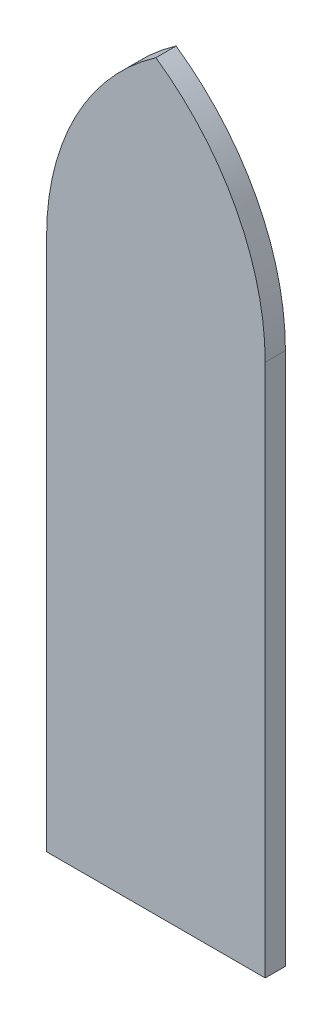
ISO-10303-21;
HEADER;
FILE_DESCRIPTION(('STEP AP214'),'2;1');
FILE_NAME('part.step','',(''),(''),'','','');
FILE_SCHEMA(('AUTOMOTIVE_DESIGN { 1 0 10303 214 1 1 1 1 }'));
ENDSEC;
DATA;
#1=APPLICATION_CONTEXT('core data for automotive mechanical design processes');
#2=APPLICATION_PROTOCOL_DEFINITION('international standard','automotive_design',2000,#1);
#3=PRODUCT_CONTEXT('',#1,'mechanical');
#4=PRODUCT('Part','Part','',(#3));
#5=PRODUCT_RELATED_PRODUCT_CATEGORY('part','',(#4));
#6=PRODUCT_DEFINITION_FORMATION('','',#4);
#7=PRODUCT_DEFINITION_CONTEXT('part definition',#1,'design');
#8=PRODUCT_DEFINITION('design','',#6,#7);
#9=PRODUCT_DEFINITION_SHAPE('','',#8);
#10=(LENGTH_UNIT() NAMED_UNIT(*) SI_UNIT(.MILLI.,.METRE.));
#11=(NAMED_UNIT(*) PLANE_ANGLE_UNIT() SI_UNIT($,.RADIAN.));
#12=(NAMED_UNIT(*) SI_UNIT($,.STERADIAN.) SOLID_ANGLE_UNIT());
#13=UNCERTAINTY_MEASURE_WITH_UNIT(LENGTH_MEASURE(1.E-05),#10,'distance_accuracy_value','');
#14=(GEOMETRIC_REPRESENTATION_CONTEXT(3) GLOBAL_UNCERTAINTY_ASSIGNED_CONTEXT((#13)) GLOBAL_UNIT_ASSIGNED_CONTEXT((#10,
#11,#12)) REPRESENTATION_CONTEXT('',''));
#15=CARTESIAN_POINT('',(0.,0.,0.));
#16=DIRECTION('',(0.,0.,1.));
#17=DIRECTION('',(1.,0.,0.));
#18=AXIS2_PLACEMENT_3D('',#15,#16,#17);
#19=CARTESIAN_POINT('',(125.,0.,15.));
#20=DIRECTION('',(0.,1.,0.));
#21=DIRECTION('',(0.,0.,1.));
#22=AXIS2_PLACEMENT_3D('',#19,#20,#21);
#23=PLANE('',#22);
#24=DIRECTION('',(1.,0.,0.));
#25=VECTOR('',#24,1.);
#26=CARTESIAN_POINT('',(125.,0.,15.));
#27=LINE('',#26,#25);
#28=CARTESIAN_POINT('',(-81.1261364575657,0.,15.));
#29=VERTEX_POINT('',#28);
#30=CARTESIAN_POINT('',(81.1261364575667,0.,15.));
#31=VERTEX_POINT('',#30);
#32=EDGE_CURVE('E11',#29,#31,#27,.T.);
#33=ORIENTED_EDGE('',*,*,#32,.F.);
#34=DIRECTION('',(0.,0.,-1.));
#35=VECTOR('',#34,1.);
#36=CARTESIAN_POINT('',(-81.1261364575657,0.,15.));
#37=LINE('',#36,#35);
#38=CARTESIAN_POINT('',(-81.1261364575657,0.,0.));
#39=VERTEX_POINT('',#38);
#40=EDGE_CURVE('E55',#29,#39,#37,.T.);
#41=ORIENTED_EDGE('',*,*,#40,.T.);
#42=DIRECTION('',(1.,0.,0.));
#43=VECTOR('',#42,1.);
#44=CARTESIAN_POINT('',(125.,0.,0.));
#45=LINE('',#44,#43);
#46=CARTESIAN_POINT('',(81.1261364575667,0.,0.));
#47=VERTEX_POINT('',#46);
#48=EDGE_CURVE('E35',#39,#47,#45,.T.);
#49=ORIENTED_EDGE('',*,*,#48,.T.);
#50=DIRECTION('',(0.,0.,-1.));
#51=VECTOR('',#50,1.);
#52=CARTESIAN_POINT('',(81.1261364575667,0.,15.));
#53=LINE('',#52,#51);
#54=EDGE_CURVE('E46',#31,#47,#53,.T.);
#55=ORIENTED_EDGE('',*,*,#54,.F.);
#56=EDGE_LOOP('',(#33,#41,#49,#55));
#57=FACE_BOUND('',#56,.T.);
#58=ADVANCED_FACE('F32',(#57),#23,.F.);
#59=CARTESIAN_POINT('',(0.,0.,15.));
#60=DIRECTION('',(0.,0.,1.));
#61=DIRECTION('',(1.,0.,0.));
#62=AXIS2_PLACEMENT_3D('',#59,#60,#61);
#63=PLANE('',#62);
#64=DIRECTION('',(0.,-1.,0.));
#65=VECTOR('',#64,1.);
#66=CARTESIAN_POINT('',(-81.1261364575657,0.,15.));
#67=LINE('',#66,#65);
#68=CARTESIAN_POINT('',(-81.1261364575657,395.794919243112,15.));
#69=VERTEX_POINT('',#68);
#70=EDGE_CURVE('E101',#69,#29,#67,.T.);
#71=ORIENTED_EDGE('',*,*,#70,.T.);
#72=ORIENTED_EDGE('',*,*,#32,.T.);
#73=DIRECTION('',(0.,1.,0.));
#74=VECTOR('',#73,1.);
#75=CARTESIAN_POINT('',(81.1261364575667,0.,15.));
#76=LINE('',#75,#74);
#77=CARTESIAN_POINT('',(81.1261364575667,395.794919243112,15.));
#78=VERTEX_POINT('',#77);
#79=EDGE_CURVE('E78',#31,#78,#76,.T.);
#80=ORIENTED_EDGE('',*,*,#79,.T.);
#81=CARTESIAN_POINT('',(-107.900904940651,395.794919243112,15.));
#82=DIRECTION('',(0.,0.,1.));
#83=DIRECTION('',(1.,0.,0.));
#84=AXIS2_PLACEMENT_3D('',#81,#82,#83);
#85=CIRCLE('',#84,189.027041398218);
#86=CARTESIAN_POINT('',(0.,551.,15.));
#87=VERTEX_POINT('',#86);
#88=EDGE_CURVE('E88',#78,#87,#85,.T.);
#89=ORIENTED_EDGE('',*,*,#88,.T.);
#90=CARTESIAN_POINT('',(107.900904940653,395.794919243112,15.));
#91=DIRECTION('',(0.,0.,1.));
#92=DIRECTION('',(-1.,0.,0.));
#93=AXIS2_PLACEMENT_3D('',#90,#91,#92);
#94=CIRCLE('',#93,189.027041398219);
#95=EDGE_CURVE('E98',#87,#69,#94,.T.);
#96=ORIENTED_EDGE('',*,*,#95,.T.);
#97=EDGE_LOOP('',(#71,#72,#80,#89,#96));
#98=FACE_BOUND('',#97,.T.);
#99=ADVANCED_FACE('F103',(#98),#63,.T.);
#100=CARTESIAN_POINT('',(0.,0.,0.));
#101=DIRECTION('',(0.,0.,1.));
#102=DIRECTION('',(1.,0.,0.));
#103=AXIS2_PLACEMENT_3D('',#100,#101,#102);
#104=PLANE('',#103);
#105=ORIENTED_EDGE('',*,*,#48,.F.);
#106=DIRECTION('',(0.,-1.,0.));
#107=VECTOR('',#106,1.);
#108=CARTESIAN_POINT('',(-81.1261364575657,0.,0.));
#109=LINE('',#108,#107);
#110=CARTESIAN_POINT('',(-81.1261364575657,395.794919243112,0.));
#111=VERTEX_POINT('',#110);
#112=EDGE_CURVE('E73',#111,#39,#109,.T.);
#113=ORIENTED_EDGE('',*,*,#112,.F.);
#114=CARTESIAN_POINT('',(107.900904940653,395.794919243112,0.));
#115=DIRECTION('',(0.,0.,1.));
#116=DIRECTION('',(-1.,0.,0.));
#117=AXIS2_PLACEMENT_3D('',#114,#115,#116);
#118=CIRCLE('',#117,189.027041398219);
#119=CARTESIAN_POINT('',(0.,551.,0.));
#120=VERTEX_POINT('',#119);
#121=EDGE_CURVE('E111',#120,#111,#118,.T.);
#122=ORIENTED_EDGE('',*,*,#121,.F.);
#123=CARTESIAN_POINT('',(-107.900904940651,395.794919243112,0.));
#124=DIRECTION('',(0.,0.,1.));
#125=DIRECTION('',(1.,0.,0.));
#126=AXIS2_PLACEMENT_3D('',#123,#124,#125);
#127=CIRCLE('',#126,189.027041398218);
#128=CARTESIAN_POINT('',(81.1261364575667,395.794919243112,0.));
#129=VERTEX_POINT('',#128);
#130=EDGE_CURVE('E90',#129,#120,#127,.T.);
#131=ORIENTED_EDGE('',*,*,#130,.F.);
#132=DIRECTION('',(0.,1.,0.));
#133=VECTOR('',#132,1.);
#134=CARTESIAN_POINT('',(81.1261364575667,0.,0.));
#135=LINE('',#134,#133);
#136=EDGE_CURVE('E108',#47,#129,#135,.T.);
#137=ORIENTED_EDGE('',*,*,#136,.F.);
#138=EDGE_LOOP('',(#105,#113,#122,#131,#137));
#139=FACE_BOUND('',#138,.T.);
#140=ADVANCED_FACE('F121',(#139),#104,.F.);
#141=CARTESIAN_POINT('',(-81.1261364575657,0.,15.));
#142=DIRECTION('',(1.,0.,0.));
#143=DIRECTION('',(0.,0.,-1.));
#144=AXIS2_PLACEMENT_3D('',#141,#142,#143);
#145=PLANE('',#144);
#146=ORIENTED_EDGE('',*,*,#112,.T.);
#147=ORIENTED_EDGE('',*,*,#40,.F.);
#148=ORIENTED_EDGE('',*,*,#70,.F.);
#149=DIRECTION('',(0.,0.,-1.));
#150=VECTOR('',#149,1.);
#151=CARTESIAN_POINT('',(-81.1261364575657,395.794919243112,15.));
#152=LINE('',#151,#150);
#153=EDGE_CURVE('E94',#69,#111,#152,.T.);
#154=ORIENTED_EDGE('',*,*,#153,.T.);
#155=EDGE_LOOP('',(#146,#147,#148,#154));
#156=FACE_BOUND('',#155,.T.);
#157=ADVANCED_FACE('F124',(#156),#145,.F.);
#158=CARTESIAN_POINT('',(107.900904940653,395.794919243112,15.));
#159=DIRECTION('',(0.,0.,-1.));
#160=DIRECTION('',(-1.,0.,0.));
#161=AXIS2_PLACEMENT_3D('',#158,#159,#160);
#162=CYLINDRICAL_SURFACE('',#161,189.027041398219);
#163=ORIENTED_EDGE('',*,*,#121,.T.);
#164=ORIENTED_EDGE('',*,*,#153,.F.);
#165=ORIENTED_EDGE('',*,*,#95,.F.);
#166=DIRECTION('',(0.,0.,-1.));
#167=VECTOR('',#166,1.);
#168=CARTESIAN_POINT('',(0.,551.,15.));
#169=LINE('',#168,#167);
#170=EDGE_CURVE('E84',#87,#120,#169,.T.);
#171=ORIENTED_EDGE('',*,*,#170,.T.);
#172=EDGE_LOOP('',(#163,#164,#165,#171));
#173=FACE_BOUND('',#172,.T.);
#174=ADVANCED_FACE('F99',(#173),#162,.T.);
#175=CARTESIAN_POINT('',(-107.900904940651,395.794919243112,15.));
#176=DIRECTION('',(0.,0.,-1.));
#177=DIRECTION('',(-1.,0.,0.));
#178=AXIS2_PLACEMENT_3D('',#175,#176,#177);
#179=CYLINDRICAL_SURFACE('',#178,189.027041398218);
#180=ORIENTED_EDGE('',*,*,#130,.T.);
#181=ORIENTED_EDGE('',*,*,#170,.F.);
#182=ORIENTED_EDGE('',*,*,#88,.F.);
#183=DIRECTION('',(0.,0.,-1.));
#184=VECTOR('',#183,1.);
#185=CARTESIAN_POINT('',(81.1261364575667,395.794919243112,15.));
#186=LINE('',#185,#184);
#187=EDGE_CURVE('E95',#78,#129,#186,.T.);
#188=ORIENTED_EDGE('',*,*,#187,.T.);
#189=EDGE_LOOP('',(#180,#181,#182,#188));
#190=FACE_BOUND('',#189,.T.);
#191=ADVANCED_FACE('F86',(#190),#179,.T.);
#192=CARTESIAN_POINT('',(81.1261364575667,0.,15.));
#193=DIRECTION('',(-1.,0.,0.));
#194=DIRECTION('',(0.,0.,1.));
#195=AXIS2_PLACEMENT_3D('',#192,#193,#194);
#196=PLANE('',#195);
#197=ORIENTED_EDGE('',*,*,#136,.T.);
#198=ORIENTED_EDGE('',*,*,#187,.F.);
#199=ORIENTED_EDGE('',*,*,#79,.F.);
#200=ORIENTED_EDGE('',*,*,#54,.T.);
#201=EDGE_LOOP('',(#197,#198,#199,#200));
#202=FACE_BOUND('',#201,.T.);
#203=ADVANCED_FACE('F117',(#202),#196,.F.);
#204=CLOSED_SHELL('',(#58,#99,#140,#157,#174,#191,#203));
#205=MANIFOLD_SOLID_BREP('B2',#204);
#206=ADVANCED_BREP_SHAPE_REPRESENTATION('',(#18,#205),#14);
#207=SHAPE_DEFINITION_REPRESENTATION(#9,#206);
ENDSEC;
END-ISO-10303-21;
